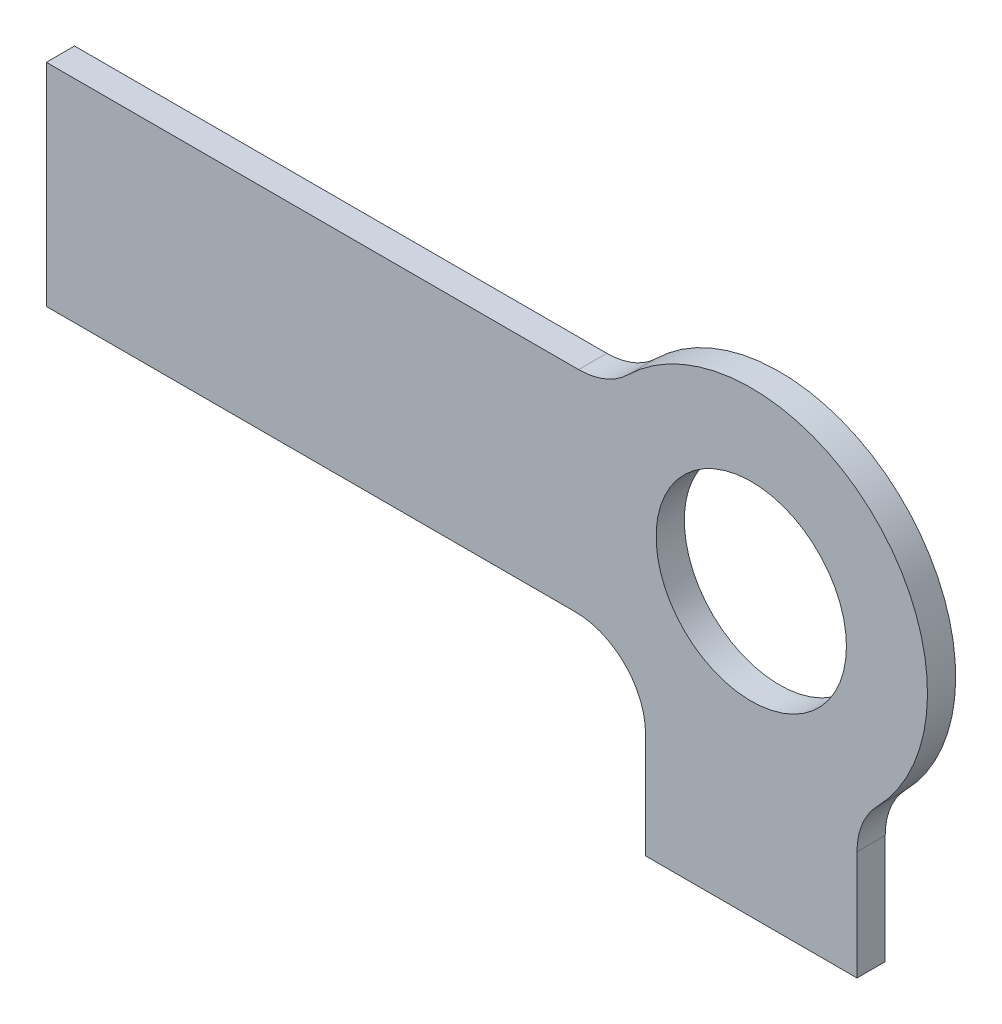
from build123d import *

# Parameters (mm, degrees)
SKETCH1_R          = 1.35
BASE_EXTRUDE_DEPTH = 0.4


with BuildPart() as part:
    # Sketch1 → Base-Extrude (new body)
    with BuildSketch(Plane.XY):
        with BuildLine():
            Line((-10, 1.5), (-2.449489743, 1.5))
            ThreePointArc((-2.449489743, 1.5), (-2.07152527, 1.5741799), (-1.749635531, 1.785714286))
            ThreePointArc((-1.749635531, 1.785714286), (1.767766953, 1.767766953), (1.785714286, -1.749635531))
            ThreePointArc((1.785714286, -1.749635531), (1.5741799, -2.07152527), (1.5, -2.449489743))
            Line((1.5, -2.449489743), (1.5, -4))
            Line((1.5, -4), (-1.5, -4))
            Line((-1.5, -4), (-1.5, -2.5))
            ThreePointArc((-1.5, -2.5), (-1.792893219, -1.792893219), (-2.5, -1.5))
            Line((-2.5, -1.5), (-10, -1.5))
            Line((-10, -1.5), (-10, 1.5))
        make_face()
        Circle(SKETCH1_R, mode=Mode.SUBTRACT)
    extrude(amount=-BASE_EXTRUDE_DEPTH)


solid = part.part
